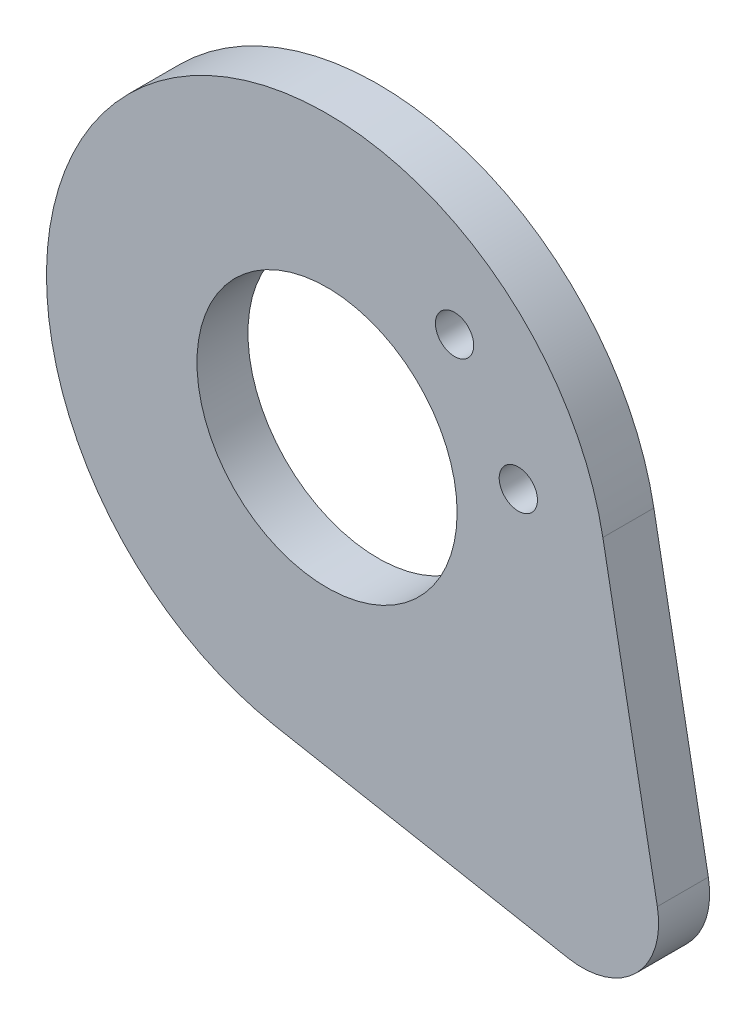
ISO-10303-21;
HEADER;
FILE_DESCRIPTION(('STEP AP214'),'2;1');
FILE_NAME('part.step','',(''),(''),'','','');
FILE_SCHEMA(('AUTOMOTIVE_DESIGN { 1 0 10303 214 1 1 1 1 }'));
ENDSEC;
DATA;
#1=APPLICATION_CONTEXT('core data for automotive mechanical design processes');
#2=APPLICATION_PROTOCOL_DEFINITION('international standard','automotive_design',2000,#1);
#3=PRODUCT_CONTEXT('',#1,'mechanical');
#4=PRODUCT('Part','Part','',(#3));
#5=PRODUCT_RELATED_PRODUCT_CATEGORY('part','',(#4));
#6=PRODUCT_DEFINITION_FORMATION('','',#4);
#7=PRODUCT_DEFINITION_CONTEXT('part definition',#1,'design');
#8=PRODUCT_DEFINITION('design','',#6,#7);
#9=PRODUCT_DEFINITION_SHAPE('','',#8);
#10=(LENGTH_UNIT() NAMED_UNIT(*) SI_UNIT(.MILLI.,.METRE.));
#11=(NAMED_UNIT(*) PLANE_ANGLE_UNIT() SI_UNIT($,.RADIAN.));
#12=(NAMED_UNIT(*) SI_UNIT($,.STERADIAN.) SOLID_ANGLE_UNIT());
#13=UNCERTAINTY_MEASURE_WITH_UNIT(LENGTH_MEASURE(1.E-05),#10,'distance_accuracy_value','');
#14=(GEOMETRIC_REPRESENTATION_CONTEXT(3) GLOBAL_UNCERTAINTY_ASSIGNED_CONTEXT((#13)) GLOBAL_UNIT_ASSIGNED_CONTEXT((#10,
#11,#12)) REPRESENTATION_CONTEXT('',''));
#15=CARTESIAN_POINT('',(0.,0.,0.));
#16=DIRECTION('',(0.,0.,1.));
#17=DIRECTION('',(1.,0.,0.));
#18=AXIS2_PLACEMENT_3D('',#15,#16,#17);
#19=CARTESIAN_POINT('',(-6.,-26.,54.4));
#20=DIRECTION('',(0.,0.,1.));
#21=DIRECTION('',(1.,0.,0.));
#22=AXIS2_PLACEMENT_3D('',#19,#20,#21);
#23=PLANE('',#22);
#24=CARTESIAN_POINT('',(-1.,-20.,54.4));
#25=DIRECTION('',(0.,0.,1.));
#26=DIRECTION('',(1.,0.,0.));
#27=AXIS2_PLACEMENT_3D('',#24,#25,#26);
#28=CIRCLE('',#27,0.75);
#29=CARTESIAN_POINT('',(-0.25,-20.,54.4));
#30=VERTEX_POINT('',#29);
#31=EDGE_CURVE('E117',#30,#30,#28,.T.);
#32=ORIENTED_EDGE('',*,*,#31,.F.);
#33=EDGE_LOOP('',(#32));
#34=FACE_BOUND('',#33,.T.);
#35=CARTESIAN_POINT('',(-6.,-26.,54.4));
#36=DIRECTION('',(0.,0.,1.));
#37=DIRECTION('',(1.,0.,0.));
#38=AXIS2_PLACEMENT_3D('',#35,#36,#37);
#39=CIRCLE('',#38,11.);
#40=CARTESIAN_POINT('',(4.81404708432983,-23.9859529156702,54.4));
#41=VERTEX_POINT('',#40);
#42=CARTESIAN_POINT('',(-8.01404708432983,-36.8140470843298,54.4));
#43=VERTEX_POINT('',#42);
#44=EDGE_CURVE('E87',#41,#43,#39,.T.);
#45=ORIENTED_EDGE('',*,*,#44,.T.);
#46=DIRECTION('',(0.98309518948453,-0.18309518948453,0.));
#47=VECTOR('',#46,1.);
#48=CARTESIAN_POINT('',(-8.01404708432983,-36.8140470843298,54.4));
#49=LINE('',#48,#47);
#50=CARTESIAN_POINT('',(3.45071443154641,-38.9492855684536,54.4));
#51=VERTEX_POINT('',#50);
#52=EDGE_CURVE('E82',#43,#51,#49,.T.);
#53=ORIENTED_EDGE('',*,*,#52,.T.);
#54=CARTESIAN_POINT('',(4.00000000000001,-36.,54.4));
#55=DIRECTION('',(0.,0.,1.));
#56=DIRECTION('',(1.,0.,0.));
#57=AXIS2_PLACEMENT_3D('',#54,#55,#56);
#58=CIRCLE('',#57,3.);
#59=CARTESIAN_POINT('',(6.94928556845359,-35.4507144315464,54.4));
#60=VERTEX_POINT('',#59);
#61=EDGE_CURVE('E85',#51,#60,#58,.T.);
#62=ORIENTED_EDGE('',*,*,#61,.T.);
#63=DIRECTION('',(-0.18309518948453,0.98309518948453,0.));
#64=VECTOR('',#63,1.);
#65=CARTESIAN_POINT('',(6.94928556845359,-35.4507144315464,54.4));
#66=LINE('',#65,#64);
#67=EDGE_CURVE('E52',#60,#41,#66,.T.);
#68=ORIENTED_EDGE('',*,*,#67,.T.);
#69=EDGE_LOOP('',(#45,#53,#62,#68));
#70=FACE_BOUND('',#69,.T.);
#71=CARTESIAN_POINT('',(-6.,-26.,54.4));
#72=DIRECTION('',(0.,0.,1.));
#73=DIRECTION('',(1.,0.,0.));
#74=AXIS2_PLACEMENT_3D('',#71,#72,#73);
#75=CIRCLE('',#74,5.1);
#76=CARTESIAN_POINT('',(-0.900000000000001,-26.,54.4));
#77=VERTEX_POINT('',#76);
#78=EDGE_CURVE('E102',#77,#77,#75,.T.);
#79=ORIENTED_EDGE('',*,*,#78,.F.);
#80=EDGE_LOOP('',(#79));
#81=FACE_BOUND('',#80,.T.);
#82=CARTESIAN_POINT('',(1.5,-24.,54.4));
#83=DIRECTION('',(0.,0.,1.));
#84=DIRECTION('',(1.,0.,0.));
#85=AXIS2_PLACEMENT_3D('',#82,#83,#84);
#86=CIRCLE('',#85,0.75);
#87=CARTESIAN_POINT('',(2.25,-24.,54.4));
#88=VERTEX_POINT('',#87);
#89=EDGE_CURVE('E123',#88,#88,#86,.T.);
#90=ORIENTED_EDGE('',*,*,#89,.F.);
#91=EDGE_LOOP('',(#90));
#92=FACE_BOUND('',#91,.T.);
#93=ADVANCED_FACE('F35',(#34,#70,#81,#92),#23,.T.);
#94=CARTESIAN_POINT('',(-6.,-26.,52.4));
#95=DIRECTION('',(0.,0.,1.));
#96=DIRECTION('',(1.,0.,0.));
#97=AXIS2_PLACEMENT_3D('',#94,#95,#96);
#98=PLANE('',#97);
#99=CARTESIAN_POINT('',(-6.,-26.,52.4));
#100=DIRECTION('',(0.,0.,1.));
#101=DIRECTION('',(1.,0.,0.));
#102=AXIS2_PLACEMENT_3D('',#99,#100,#101);
#103=CIRCLE('',#102,11.);
#104=CARTESIAN_POINT('',(4.81404708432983,-23.9859529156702,52.4));
#105=VERTEX_POINT('',#104);
#106=CARTESIAN_POINT('',(-8.01404708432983,-36.8140470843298,52.4));
#107=VERTEX_POINT('',#106);
#108=EDGE_CURVE('E99',#105,#107,#103,.T.);
#109=ORIENTED_EDGE('',*,*,#108,.F.);
#110=DIRECTION('',(-0.18309518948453,0.98309518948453,0.));
#111=VECTOR('',#110,1.);
#112=CARTESIAN_POINT('',(6.94928556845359,-35.4507144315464,52.4));
#113=LINE('',#112,#111);
#114=CARTESIAN_POINT('',(6.94928556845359,-35.4507144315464,52.4));
#115=VERTEX_POINT('',#114);
#116=EDGE_CURVE('E75',#115,#105,#113,.T.);
#117=ORIENTED_EDGE('',*,*,#116,.F.);
#118=CARTESIAN_POINT('',(4.00000000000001,-36.,52.4));
#119=DIRECTION('',(0.,0.,1.));
#120=DIRECTION('',(1.,0.,0.));
#121=AXIS2_PLACEMENT_3D('',#118,#119,#120);
#122=CIRCLE('',#121,3.);
#123=CARTESIAN_POINT('',(3.45071443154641,-38.9492855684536,52.4));
#124=VERTEX_POINT('',#123);
#125=EDGE_CURVE('E69',#124,#115,#122,.T.);
#126=ORIENTED_EDGE('',*,*,#125,.F.);
#127=DIRECTION('',(0.98309518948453,-0.18309518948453,0.));
#128=VECTOR('',#127,1.);
#129=CARTESIAN_POINT('',(-8.01404708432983,-36.8140470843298,52.4));
#130=LINE('',#129,#128);
#131=EDGE_CURVE('E91',#107,#124,#130,.T.);
#132=ORIENTED_EDGE('',*,*,#131,.F.);
#133=EDGE_LOOP('',(#109,#117,#126,#132));
#134=FACE_BOUND('',#133,.T.);
#135=CARTESIAN_POINT('',(-6.,-26.,52.4));
#136=DIRECTION('',(0.,0.,1.));
#137=DIRECTION('',(1.,0.,0.));
#138=AXIS2_PLACEMENT_3D('',#135,#136,#137);
#139=CIRCLE('',#138,5.1);
#140=CARTESIAN_POINT('',(-0.900000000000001,-26.,52.4));
#141=VERTEX_POINT('',#140);
#142=EDGE_CURVE('E114',#141,#141,#139,.T.);
#143=ORIENTED_EDGE('',*,*,#142,.T.);
#144=EDGE_LOOP('',(#143));
#145=FACE_BOUND('',#144,.T.);
#146=CARTESIAN_POINT('',(-1.,-20.,52.4));
#147=DIRECTION('',(0.,0.,1.));
#148=DIRECTION('',(1.,0.,0.));
#149=AXIS2_PLACEMENT_3D('',#146,#147,#148);
#150=CIRCLE('',#149,0.75);
#151=CARTESIAN_POINT('',(-0.25,-20.,52.4));
#152=VERTEX_POINT('',#151);
#153=EDGE_CURVE('E120',#152,#152,#150,.T.);
#154=ORIENTED_EDGE('',*,*,#153,.T.);
#155=EDGE_LOOP('',(#154));
#156=FACE_BOUND('',#155,.T.);
#157=CARTESIAN_POINT('',(1.5,-24.,52.4));
#158=DIRECTION('',(0.,0.,1.));
#159=DIRECTION('',(1.,0.,0.));
#160=AXIS2_PLACEMENT_3D('',#157,#158,#159);
#161=CIRCLE('',#160,0.75);
#162=CARTESIAN_POINT('',(2.25,-24.,52.4));
#163=VERTEX_POINT('',#162);
#164=EDGE_CURVE('E126',#163,#163,#161,.T.);
#165=ORIENTED_EDGE('',*,*,#164,.T.);
#166=EDGE_LOOP('',(#165));
#167=FACE_BOUND('',#166,.T.);
#168=ADVANCED_FACE('F110',(#134,#145,#156,#167),#98,.F.);
#169=CARTESIAN_POINT('',(-6.,-26.,54.4));
#170=DIRECTION('',(0.,0.,-1.));
#171=DIRECTION('',(-1.,0.,0.));
#172=AXIS2_PLACEMENT_3D('',#169,#170,#171);
#173=CYLINDRICAL_SURFACE('',#172,11.);
#174=ORIENTED_EDGE('',*,*,#108,.T.);
#175=DIRECTION('',(0.,0.,-1.));
#176=VECTOR('',#175,1.);
#177=CARTESIAN_POINT('',(-8.01404708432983,-36.8140470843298,54.4));
#178=LINE('',#177,#176);
#179=EDGE_CURVE('E11',#43,#107,#178,.T.);
#180=ORIENTED_EDGE('',*,*,#179,.F.);
#181=ORIENTED_EDGE('',*,*,#44,.F.);
#182=DIRECTION('',(0.,0.,-1.));
#183=VECTOR('',#182,1.);
#184=CARTESIAN_POINT('',(4.81404708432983,-23.9859529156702,54.4));
#185=LINE('',#184,#183);
#186=EDGE_CURVE('E95',#41,#105,#185,.T.);
#187=ORIENTED_EDGE('',*,*,#186,.T.);
#188=EDGE_LOOP('',(#174,#180,#181,#187));
#189=FACE_BOUND('',#188,.T.);
#190=ADVANCED_FACE('F37',(#189),#173,.T.);
#191=CARTESIAN_POINT('',(-8.01404708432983,-36.8140470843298,54.4));
#192=DIRECTION('',(0.18309518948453,0.98309518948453,0.));
#193=DIRECTION('',(-0.98309518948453,0.18309518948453,0.));
#194=AXIS2_PLACEMENT_3D('',#191,#192,#193);
#195=PLANE('',#194);
#196=ORIENTED_EDGE('',*,*,#131,.T.);
#197=DIRECTION('',(0.,0.,-1.));
#198=VECTOR('',#197,1.);
#199=CARTESIAN_POINT('',(3.45071443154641,-38.9492855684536,54.4));
#200=LINE('',#199,#198);
#201=EDGE_CURVE('E44',#51,#124,#200,.T.);
#202=ORIENTED_EDGE('',*,*,#201,.F.);
#203=ORIENTED_EDGE('',*,*,#52,.F.);
#204=ORIENTED_EDGE('',*,*,#179,.T.);
#205=EDGE_LOOP('',(#196,#202,#203,#204));
#206=FACE_BOUND('',#205,.T.);
#207=ADVANCED_FACE('F90',(#206),#195,.F.);
#208=CARTESIAN_POINT('',(4.00000000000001,-36.,54.4));
#209=DIRECTION('',(0.,0.,-1.));
#210=DIRECTION('',(-1.,0.,0.));
#211=AXIS2_PLACEMENT_3D('',#208,#209,#210);
#212=CYLINDRICAL_SURFACE('',#211,3.);
#213=ORIENTED_EDGE('',*,*,#125,.T.);
#214=DIRECTION('',(0.,0.,-1.));
#215=VECTOR('',#214,1.);
#216=CARTESIAN_POINT('',(6.94928556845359,-35.4507144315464,54.4));
#217=LINE('',#216,#215);
#218=EDGE_CURVE('E92',#60,#115,#217,.T.);
#219=ORIENTED_EDGE('',*,*,#218,.F.);
#220=ORIENTED_EDGE('',*,*,#61,.F.);
#221=ORIENTED_EDGE('',*,*,#201,.T.);
#222=EDGE_LOOP('',(#213,#219,#220,#221));
#223=FACE_BOUND('',#222,.T.);
#224=ADVANCED_FACE('F93',(#223),#212,.T.);
#225=CARTESIAN_POINT('',(6.94928556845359,-35.4507144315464,54.4));
#226=DIRECTION('',(-0.98309518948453,-0.18309518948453,0.));
#227=DIRECTION('',(0.18309518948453,-0.98309518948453,0.));
#228=AXIS2_PLACEMENT_3D('',#225,#226,#227);
#229=PLANE('',#228);
#230=ORIENTED_EDGE('',*,*,#116,.T.);
#231=ORIENTED_EDGE('',*,*,#186,.F.);
#232=ORIENTED_EDGE('',*,*,#67,.F.);
#233=ORIENTED_EDGE('',*,*,#218,.T.);
#234=EDGE_LOOP('',(#230,#231,#232,#233));
#235=FACE_BOUND('',#234,.T.);
#236=ADVANCED_FACE('F107',(#235),#229,.F.);
#237=CARTESIAN_POINT('',(-6.,-26.,54.4));
#238=DIRECTION('',(0.,0.,-1.));
#239=DIRECTION('',(-1.,0.,0.));
#240=AXIS2_PLACEMENT_3D('',#237,#238,#239);
#241=CYLINDRICAL_SURFACE('',#240,5.1);
#242=ORIENTED_EDGE('',*,*,#78,.T.);
#243=EDGE_LOOP('',(#242));
#244=FACE_BOUND('',#243,.T.);
#245=ORIENTED_EDGE('',*,*,#142,.F.);
#246=EDGE_LOOP('',(#245));
#247=FACE_BOUND('',#246,.T.);
#248=ADVANCED_FACE('F144',(#244,#247),#241,.F.);
#249=CARTESIAN_POINT('',(-1.,-20.,54.4));
#250=DIRECTION('',(0.,0.,-1.));
#251=DIRECTION('',(-1.,0.,0.));
#252=AXIS2_PLACEMENT_3D('',#249,#250,#251);
#253=CYLINDRICAL_SURFACE('',#252,0.75);
#254=ORIENTED_EDGE('',*,*,#31,.T.);
#255=EDGE_LOOP('',(#254));
#256=FACE_BOUND('',#255,.T.);
#257=ORIENTED_EDGE('',*,*,#153,.F.);
#258=EDGE_LOOP('',(#257));
#259=FACE_BOUND('',#258,.T.);
#260=ADVANCED_FACE('F190',(#256,#259),#253,.F.);
#261=CARTESIAN_POINT('',(1.5,-24.,54.4));
#262=DIRECTION('',(0.,0.,-1.));
#263=DIRECTION('',(-1.,0.,0.));
#264=AXIS2_PLACEMENT_3D('',#261,#262,#263);
#265=CYLINDRICAL_SURFACE('',#264,0.75);
#266=ORIENTED_EDGE('',*,*,#89,.T.);
#267=EDGE_LOOP('',(#266));
#268=FACE_BOUND('',#267,.T.);
#269=ORIENTED_EDGE('',*,*,#164,.F.);
#270=EDGE_LOOP('',(#269));
#271=FACE_BOUND('',#270,.T.);
#272=ADVANCED_FACE('F132',(#268,#271),#265,.F.);
#273=CLOSED_SHELL('',(#93,#168,#190,#207,#224,#236,#248,#260,#272));
#274=MANIFOLD_SOLID_BREP('B2',#273);
#275=ADVANCED_BREP_SHAPE_REPRESENTATION('',(#18,#274),#14);
#276=SHAPE_DEFINITION_REPRESENTATION(#9,#275);
ENDSEC;
END-ISO-10303-21;
